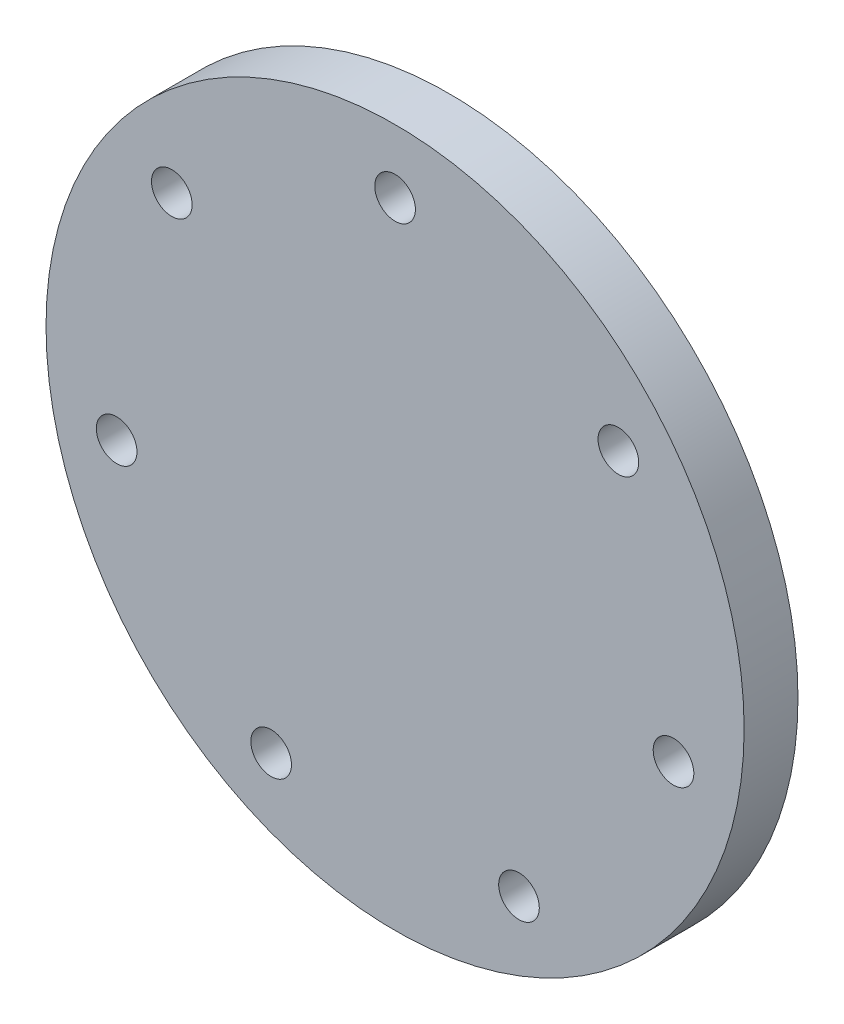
from build123d import *

# Parameters (mm, degrees)
SKIZZE1_R                       = 64.829395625
AUFSATZ_LINEAR_AUSTRAGEN1_DEPTH = 10
SKIZZE2_R                       = 3.773004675
SCHNITT_LINEAR_AUSTRAGEN1_DEPTH = 10
KREISMUSTER1_COUNT              = 7


with BuildPart() as part:
    # Skizze1 → Aufsatz-Linear austragen1 (new body)
    with BuildSketch(Plane.XY):
        Circle(SKIZZE1_R)
    extrude(amount=AUFSATZ_LINEAR_AUSTRAGEN1_DEPTH)

    # Skizze2 → Schnitt-Linear austragen1 (cut)
    with BuildSketch(Plane.XY.offset(10)):
        with Locations((0, 53.038358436)):
            Circle(SKIZZE2_R)
    schnitt_linear_austragen1 = extrude(amount=-SCHNITT_LINEAR_AUSTRAGEN1_DEPTH, mode=Mode.SUBTRACT)

    # Kreismuster1: Schnitt-Linear austragen1 ×7 about axis
    kreismuster1_axis = Axis((0, 0, 0), (0, 0, 1))
    for i in range(1, KREISMUSTER1_COUNT):
        add(schnitt_linear_austragen1.rotate(kreismuster1_axis, i * 360 / KREISMUSTER1_COUNT), mode=Mode.SUBTRACT)


solid = part.part
